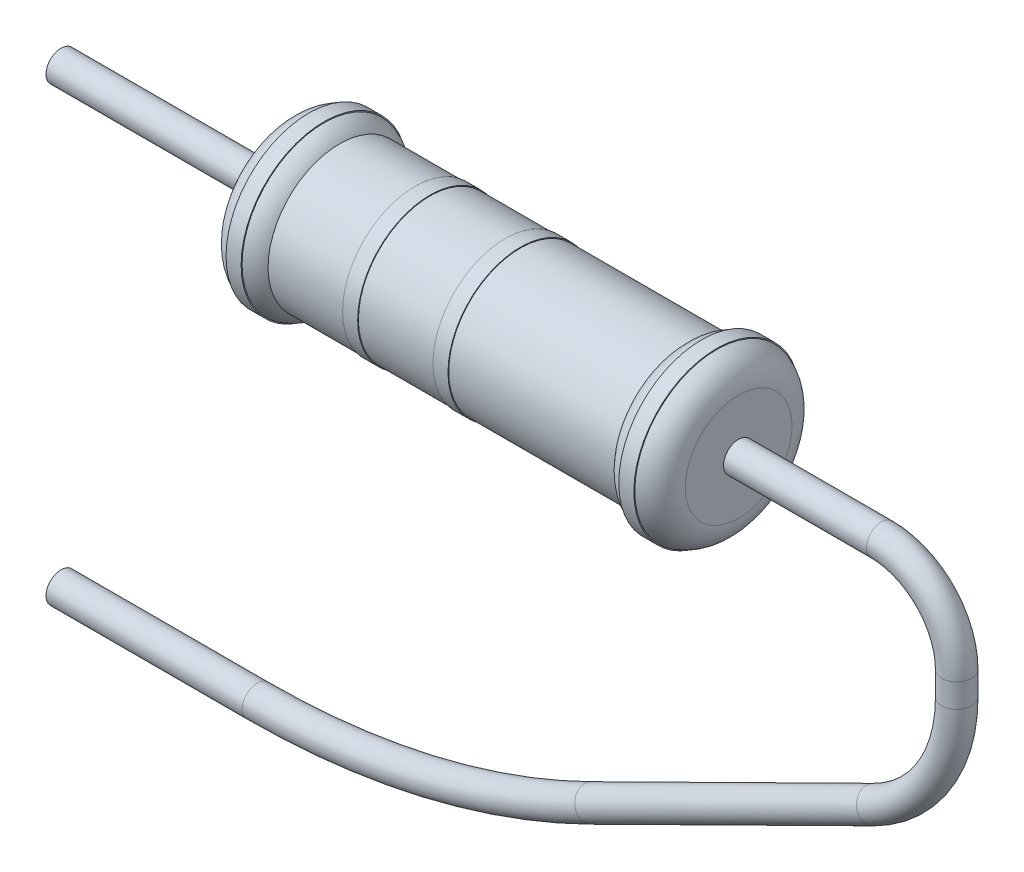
ISO-10303-21;
HEADER;
FILE_DESCRIPTION(('STEP AP214'),'2;1');
FILE_NAME('part.step','',(''),(''),'','','');
FILE_SCHEMA(('AUTOMOTIVE_DESIGN { 1 0 10303 214 1 1 1 1 }'));
ENDSEC;
DATA;
#1=APPLICATION_CONTEXT('core data for automotive mechanical design processes');
#2=APPLICATION_PROTOCOL_DEFINITION('international standard','automotive_design',2000,#1);
#3=PRODUCT_CONTEXT('',#1,'mechanical');
#4=PRODUCT('Part','Part','',(#3));
#5=PRODUCT_RELATED_PRODUCT_CATEGORY('part','',(#4));
#6=PRODUCT_DEFINITION_FORMATION('','',#4);
#7=PRODUCT_DEFINITION_CONTEXT('part definition',#1,'design');
#8=PRODUCT_DEFINITION('design','',#6,#7);
#9=PRODUCT_DEFINITION_SHAPE('','',#8);
#10=(LENGTH_UNIT() NAMED_UNIT(*) SI_UNIT(.MILLI.,.METRE.));
#11=(NAMED_UNIT(*) PLANE_ANGLE_UNIT() SI_UNIT($,.RADIAN.));
#12=(NAMED_UNIT(*) SI_UNIT($,.STERADIAN.) SOLID_ANGLE_UNIT());
#13=UNCERTAINTY_MEASURE_WITH_UNIT(LENGTH_MEASURE(1.E-05),#10,'distance_accuracy_value','');
#14=(GEOMETRIC_REPRESENTATION_CONTEXT(3) GLOBAL_UNCERTAINTY_ASSIGNED_CONTEXT((#13)) GLOBAL_UNIT_ASSIGNED_CONTEXT((#10,
#11,#12)) REPRESENTATION_CONTEXT('',''));
#15=CARTESIAN_POINT('',(0.,0.,0.));
#16=DIRECTION('',(0.,0.,1.));
#17=DIRECTION('',(1.,0.,0.));
#18=AXIS2_PLACEMENT_3D('',#15,#16,#17);
#19=CARTESIAN_POINT('',(3.,0.,0.));
#20=DIRECTION('',(-1.,0.,0.));
#21=DIRECTION('',(0.,0.,1.));
#22=AXIS2_PLACEMENT_3D('',#19,#20,#21);
#23=PLANE('',#22);
#24=CARTESIAN_POINT('',(3.,0.,0.));
#25=DIRECTION('',(-1.,0.,0.));
#26=DIRECTION('',(0.,0.,1.));
#27=AXIS2_PLACEMENT_3D('',#24,#25,#26);
#28=CIRCLE('',#27,0.708257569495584);
#29=CARTESIAN_POINT('',(3.,0.,0.708257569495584));
#30=VERTEX_POINT('',#29);
#31=EDGE_CURVE('E36',#30,#30,#28,.T.);
#32=ORIENTED_EDGE('',*,*,#31,.F.);
#33=EDGE_LOOP('',(#32));
#34=FACE_BOUND('',#33,.T.);
#35=CARTESIAN_POINT('',(3.,0.,0.));
#36=DIRECTION('',(1.,0.,0.));
#37=DIRECTION('',(0.,0.,-1.));
#38=AXIS2_PLACEMENT_3D('',#35,#36,#37);
#39=CIRCLE('',#38,0.2);
#40=CARTESIAN_POINT('',(3.,0.,-0.2));
#41=VERTEX_POINT('',#40);
#42=EDGE_CURVE('E10',#41,#41,#39,.T.);
#43=ORIENTED_EDGE('',*,*,#42,.F.);
#44=EDGE_LOOP('',(#43));
#45=FACE_BOUND('',#44,.T.);
#46=ADVANCED_FACE('F24',(#34,#45),#23,.F.);
#47=CARTESIAN_POINT('',(-3.,0.,0.));
#48=DIRECTION('',(1.,0.,0.));
#49=DIRECTION('',(0.,0.,-1.));
#50=AXIS2_PLACEMENT_3D('',#47,#48,#49);
#51=PLANE('',#50);
#52=CARTESIAN_POINT('',(-3.,0.,0.));
#53=DIRECTION('',(-1.,0.,0.));
#54=DIRECTION('',(0.,0.,1.));
#55=AXIS2_PLACEMENT_3D('',#52,#53,#54);
#56=CIRCLE('',#55,0.708257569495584);
#57=CARTESIAN_POINT('',(-3.,0.,0.708257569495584));
#58=VERTEX_POINT('',#57);
#59=EDGE_CURVE('E62',#58,#58,#56,.T.);
#60=ORIENTED_EDGE('',*,*,#59,.T.);
#61=EDGE_LOOP('',(#60));
#62=FACE_BOUND('',#61,.T.);
#63=CARTESIAN_POINT('',(-3.,0.,0.));
#64=DIRECTION('',(1.,0.,0.));
#65=DIRECTION('',(0.,0.,-1.));
#66=AXIS2_PLACEMENT_3D('',#63,#64,#65);
#67=CIRCLE('',#66,0.2);
#68=CARTESIAN_POINT('',(-3.,0.,-0.2));
#69=VERTEX_POINT('',#68);
#70=EDGE_CURVE('E28',#69,#69,#67,.F.);
#71=ORIENTED_EDGE('',*,*,#70,.F.);
#72=EDGE_LOOP('',(#71));
#73=FACE_BOUND('',#72,.T.);
#74=ADVANCED_FACE('F26',(#62,#73),#51,.F.);
#75=CARTESIAN_POINT('',(2.60825756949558,0.,0.));
#76=DIRECTION('',(-1.,0.,0.));
#77=DIRECTION('',(0.,0.,1.));
#78=AXIS2_PLACEMENT_3D('',#75,#76,#77);
#79=TOROIDAL_SURFACE('',#78,0.708257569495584,0.391742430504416);
#80=CARTESIAN_POINT('',(2.70825756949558,0.,0.));
#81=DIRECTION('',(-1.,0.,0.));
#82=DIRECTION('',(0.,0.,1.));
#83=AXIS2_PLACEMENT_3D('',#80,#81,#82);
#84=CIRCLE('',#83,1.08702152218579);
#85=CARTESIAN_POINT('',(2.70825756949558,0.,1.08702152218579));
#86=VERTEX_POINT('',#85);
#87=EDGE_CURVE('E116',#86,#86,#84,.T.);
#88=ORIENTED_EDGE('',*,*,#87,.F.);
#89=EDGE_LOOP('',(#88));
#90=FACE_BOUND('',#89,.T.);
#91=ORIENTED_EDGE('',*,*,#31,.T.);
#92=EDGE_LOOP('',(#91));
#93=FACE_BOUND('',#92,.T.);
#94=ADVANCED_FACE('F121',(#90,#93),#79,.T.);
#95=CARTESIAN_POINT('',(2.70825756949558,1.08702152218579,0.));
#96=DIRECTION('',(-1.,0.,0.));
#97=DIRECTION('',(0.,0.,1.));
#98=AXIS2_PLACEMENT_3D('',#95,#96,#97);
#99=PLANE('',#98);
#100=CARTESIAN_POINT('',(2.70825756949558,0.,0.));
#101=DIRECTION('',(-1.,0.,0.));
#102=DIRECTION('',(0.,0.,1.));
#103=AXIS2_PLACEMENT_3D('',#100,#101,#102);
#104=CIRCLE('',#103,1.1);
#105=CARTESIAN_POINT('',(2.70825756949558,0.,1.1));
#106=VERTEX_POINT('',#105);
#107=EDGE_CURVE('E113',#106,#106,#104,.T.);
#108=ORIENTED_EDGE('',*,*,#107,.F.);
#109=EDGE_LOOP('',(#108));
#110=FACE_BOUND('',#109,.T.);
#111=ORIENTED_EDGE('',*,*,#87,.T.);
#112=EDGE_LOOP('',(#111));
#113=FACE_BOUND('',#112,.T.);
#114=ADVANCED_FACE('F134',(#110,#113),#99,.F.);
#115=CARTESIAN_POINT('',(-9.42004899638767,0.,0.));
#116=DIRECTION('',(-1.,0.,0.));
#117=DIRECTION('',(0.,0.,1.));
#118=AXIS2_PLACEMENT_3D('',#115,#116,#117);
#119=CYLINDRICAL_SURFACE('',#118,1.1);
#120=CARTESIAN_POINT('',(2.50825756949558,0.,0.));
#121=DIRECTION('',(-1.,0.,0.));
#122=DIRECTION('',(0.,0.,1.));
#123=AXIS2_PLACEMENT_3D('',#120,#121,#122);
#124=CIRCLE('',#123,1.1);
#125=CARTESIAN_POINT('',(2.50825756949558,0.,1.1));
#126=VERTEX_POINT('',#125);
#127=EDGE_CURVE('E110',#126,#126,#124,.T.);
#128=ORIENTED_EDGE('',*,*,#127,.F.);
#129=EDGE_LOOP('',(#128));
#130=FACE_BOUND('',#129,.T.);
#131=ORIENTED_EDGE('',*,*,#107,.T.);
#132=EDGE_LOOP('',(#131));
#133=FACE_BOUND('',#132,.T.);
#134=ADVANCED_FACE('F138',(#130,#133),#119,.T.);
#135=CARTESIAN_POINT('',(2.50825756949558,1.08702152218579,0.));
#136=DIRECTION('',(1.,0.,0.));
#137=DIRECTION('',(0.,0.,-1.));
#138=AXIS2_PLACEMENT_3D('',#135,#136,#137);
#139=PLANE('',#138);
#140=CARTESIAN_POINT('',(2.50825756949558,0.,0.));
#141=DIRECTION('',(-1.,0.,0.));
#142=DIRECTION('',(0.,0.,1.));
#143=AXIS2_PLACEMENT_3D('',#140,#141,#142);
#144=CIRCLE('',#143,1.08702152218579);
#145=CARTESIAN_POINT('',(2.50825756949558,0.,1.08702152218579));
#146=VERTEX_POINT('',#145);
#147=EDGE_CURVE('E107',#146,#146,#144,.T.);
#148=ORIENTED_EDGE('',*,*,#147,.F.);
#149=EDGE_LOOP('',(#148));
#150=FACE_BOUND('',#149,.T.);
#151=ORIENTED_EDGE('',*,*,#127,.T.);
#152=EDGE_LOOP('',(#151));
#153=FACE_BOUND('',#152,.T.);
#154=ADVANCED_FACE('F142',(#150,#153),#139,.F.);
#155=CARTESIAN_POINT('',(2.60825756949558,0.,0.));
#156=DIRECTION('',(-1.,0.,0.));
#157=DIRECTION('',(0.,0.,1.));
#158=AXIS2_PLACEMENT_3D('',#155,#156,#157);
#159=TOROIDAL_SURFACE('',#158,0.708257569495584,0.391742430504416);
#160=CARTESIAN_POINT('',(2.3,0.,0.));
#161=DIRECTION('',(-1.,0.,0.));
#162=DIRECTION('',(0.,0.,1.));
#163=AXIS2_PLACEMENT_3D('',#160,#161,#162);
#164=CIRCLE('',#163,0.95);
#165=CARTESIAN_POINT('',(2.3,0.,0.95));
#166=VERTEX_POINT('',#165);
#167=EDGE_CURVE('E104',#166,#166,#164,.T.);
#168=ORIENTED_EDGE('',*,*,#167,.F.);
#169=EDGE_LOOP('',(#168));
#170=FACE_BOUND('',#169,.T.);
#171=ORIENTED_EDGE('',*,*,#147,.T.);
#172=EDGE_LOOP('',(#171));
#173=FACE_BOUND('',#172,.T.);
#174=ADVANCED_FACE('F146',(#170,#173),#159,.T.);
#175=CARTESIAN_POINT('',(-9.42004899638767,0.,0.));
#176=DIRECTION('',(-1.,0.,0.));
#177=DIRECTION('',(0.,0.,1.));
#178=AXIS2_PLACEMENT_3D('',#175,#176,#177);
#179=CYLINDRICAL_SURFACE('',#178,0.95);
#180=CARTESIAN_POINT('',(0.0999999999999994,0.,0.));
#181=DIRECTION('',(-1.,0.,0.));
#182=DIRECTION('',(0.,0.,1.));
#183=AXIS2_PLACEMENT_3D('',#180,#181,#182);
#184=CIRCLE('',#183,0.95);
#185=CARTESIAN_POINT('',(0.0999999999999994,0.,0.95));
#186=VERTEX_POINT('',#185);
#187=EDGE_CURVE('E101',#186,#186,#184,.T.);
#188=ORIENTED_EDGE('',*,*,#187,.F.);
#189=EDGE_LOOP('',(#188));
#190=FACE_BOUND('',#189,.T.);
#191=ORIENTED_EDGE('',*,*,#167,.T.);
#192=EDGE_LOOP('',(#191));
#193=FACE_BOUND('',#192,.T.);
#194=ADVANCED_FACE('F150',(#190,#193),#179,.T.);
#195=CARTESIAN_POINT('',(0.1,0.95,0.));
#196=DIRECTION('',(-1.,0.,0.));
#197=DIRECTION('',(0.,0.,1.));
#198=AXIS2_PLACEMENT_3D('',#195,#196,#197);
#199=PLANE('',#198);
#200=CARTESIAN_POINT('',(0.0999999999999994,0.,0.));
#201=DIRECTION('',(-1.,0.,0.));
#202=DIRECTION('',(0.,0.,1.));
#203=AXIS2_PLACEMENT_3D('',#200,#201,#202);
#204=CIRCLE('',#203,0.96);
#205=CARTESIAN_POINT('',(0.0999999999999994,0.,0.96));
#206=VERTEX_POINT('',#205);
#207=EDGE_CURVE('E98',#206,#206,#204,.T.);
#208=ORIENTED_EDGE('',*,*,#207,.F.);
#209=EDGE_LOOP('',(#208));
#210=FACE_BOUND('',#209,.T.);
#211=ORIENTED_EDGE('',*,*,#187,.T.);
#212=EDGE_LOOP('',(#211));
#213=FACE_BOUND('',#212,.T.);
#214=ADVANCED_FACE('F154',(#210,#213),#199,.F.);
#215=CARTESIAN_POINT('',(-9.42004899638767,0.,0.));
#216=DIRECTION('',(-1.,0.,0.));
#217=DIRECTION('',(0.,0.,1.));
#218=AXIS2_PLACEMENT_3D('',#215,#216,#217);
#219=CYLINDRICAL_SURFACE('',#218,0.96);
#220=CARTESIAN_POINT('',(-0.0999999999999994,0.,0.));
#221=DIRECTION('',(-1.,0.,0.));
#222=DIRECTION('',(0.,0.,1.));
#223=AXIS2_PLACEMENT_3D('',#220,#221,#222);
#224=CIRCLE('',#223,0.96);
#225=CARTESIAN_POINT('',(-0.0999999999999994,0.,0.96));
#226=VERTEX_POINT('',#225);
#227=EDGE_CURVE('E95',#226,#226,#224,.T.);
#228=ORIENTED_EDGE('',*,*,#227,.F.);
#229=EDGE_LOOP('',(#228));
#230=FACE_BOUND('',#229,.T.);
#231=ORIENTED_EDGE('',*,*,#207,.T.);
#232=EDGE_LOOP('',(#231));
#233=FACE_BOUND('',#232,.T.);
#234=ADVANCED_FACE('F158',(#230,#233),#219,.T.);
#235=CARTESIAN_POINT('',(-0.1,0.95,0.));
#236=DIRECTION('',(1.,0.,0.));
#237=DIRECTION('',(0.,0.,-1.));
#238=AXIS2_PLACEMENT_3D('',#235,#236,#237);
#239=PLANE('',#238);
#240=CARTESIAN_POINT('',(-0.0999999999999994,0.,0.));
#241=DIRECTION('',(-1.,0.,0.));
#242=DIRECTION('',(0.,0.,1.));
#243=AXIS2_PLACEMENT_3D('',#240,#241,#242);
#244=CIRCLE('',#243,0.95);
#245=CARTESIAN_POINT('',(-0.0999999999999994,0.,0.95));
#246=VERTEX_POINT('',#245);
#247=EDGE_CURVE('E92',#246,#246,#244,.T.);
#248=ORIENTED_EDGE('',*,*,#247,.F.);
#249=EDGE_LOOP('',(#248));
#250=FACE_BOUND('',#249,.T.);
#251=ORIENTED_EDGE('',*,*,#227,.T.);
#252=EDGE_LOOP('',(#251));
#253=FACE_BOUND('',#252,.T.);
#254=ADVANCED_FACE('F162',(#250,#253),#239,.F.);
#255=CARTESIAN_POINT('',(-9.42004899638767,0.,0.));
#256=DIRECTION('',(-1.,0.,0.));
#257=DIRECTION('',(0.,0.,1.));
#258=AXIS2_PLACEMENT_3D('',#255,#256,#257);
#259=CYLINDRICAL_SURFACE('',#258,0.95);
#260=CARTESIAN_POINT('',(-1.1,0.,0.));
#261=DIRECTION('',(-1.,0.,0.));
#262=DIRECTION('',(0.,0.,1.));
#263=AXIS2_PLACEMENT_3D('',#260,#261,#262);
#264=CIRCLE('',#263,0.95);
#265=CARTESIAN_POINT('',(-1.1,0.,0.95));
#266=VERTEX_POINT('',#265);
#267=EDGE_CURVE('E89',#266,#266,#264,.T.);
#268=ORIENTED_EDGE('',*,*,#267,.F.);
#269=EDGE_LOOP('',(#268));
#270=FACE_BOUND('',#269,.T.);
#271=ORIENTED_EDGE('',*,*,#247,.T.);
#272=EDGE_LOOP('',(#271));
#273=FACE_BOUND('',#272,.T.);
#274=ADVANCED_FACE('F166',(#270,#273),#259,.T.);
#275=CARTESIAN_POINT('',(-1.1,0.95,0.));
#276=DIRECTION('',(-1.,0.,0.));
#277=DIRECTION('',(0.,0.,1.));
#278=AXIS2_PLACEMENT_3D('',#275,#276,#277);
#279=PLANE('',#278);
#280=CARTESIAN_POINT('',(-1.1,0.,0.));
#281=DIRECTION('',(-1.,0.,0.));
#282=DIRECTION('',(0.,0.,1.));
#283=AXIS2_PLACEMENT_3D('',#280,#281,#282);
#284=CIRCLE('',#283,0.96);
#285=CARTESIAN_POINT('',(-1.1,0.,0.96));
#286=VERTEX_POINT('',#285);
#287=EDGE_CURVE('E86',#286,#286,#284,.T.);
#288=ORIENTED_EDGE('',*,*,#287,.F.);
#289=EDGE_LOOP('',(#288));
#290=FACE_BOUND('',#289,.T.);
#291=ORIENTED_EDGE('',*,*,#267,.T.);
#292=EDGE_LOOP('',(#291));
#293=FACE_BOUND('',#292,.T.);
#294=ADVANCED_FACE('F170',(#290,#293),#279,.F.);
#295=CARTESIAN_POINT('',(-9.42004899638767,0.,0.));
#296=DIRECTION('',(-1.,0.,0.));
#297=DIRECTION('',(0.,0.,1.));
#298=AXIS2_PLACEMENT_3D('',#295,#296,#297);
#299=CYLINDRICAL_SURFACE('',#298,0.96);
#300=CARTESIAN_POINT('',(-1.3,0.,0.));
#301=DIRECTION('',(-1.,0.,0.));
#302=DIRECTION('',(0.,0.,1.));
#303=AXIS2_PLACEMENT_3D('',#300,#301,#302);
#304=CIRCLE('',#303,0.96);
#305=CARTESIAN_POINT('',(-1.3,0.,0.96));
#306=VERTEX_POINT('',#305);
#307=EDGE_CURVE('E83',#306,#306,#304,.T.);
#308=ORIENTED_EDGE('',*,*,#307,.F.);
#309=EDGE_LOOP('',(#308));
#310=FACE_BOUND('',#309,.T.);
#311=ORIENTED_EDGE('',*,*,#287,.T.);
#312=EDGE_LOOP('',(#311));
#313=FACE_BOUND('',#312,.T.);
#314=ADVANCED_FACE('F174',(#310,#313),#299,.T.);
#315=CARTESIAN_POINT('',(-1.3,0.95,0.));
#316=DIRECTION('',(1.,0.,0.));
#317=DIRECTION('',(0.,0.,-1.));
#318=AXIS2_PLACEMENT_3D('',#315,#316,#317);
#319=PLANE('',#318);
#320=CARTESIAN_POINT('',(-1.3,0.,0.));
#321=DIRECTION('',(-1.,0.,0.));
#322=DIRECTION('',(0.,0.,1.));
#323=AXIS2_PLACEMENT_3D('',#320,#321,#322);
#324=CIRCLE('',#323,0.95);
#325=CARTESIAN_POINT('',(-1.3,0.,0.95));
#326=VERTEX_POINT('',#325);
#327=EDGE_CURVE('E80',#326,#326,#324,.T.);
#328=ORIENTED_EDGE('',*,*,#327,.F.);
#329=EDGE_LOOP('',(#328));
#330=FACE_BOUND('',#329,.T.);
#331=ORIENTED_EDGE('',*,*,#307,.T.);
#332=EDGE_LOOP('',(#331));
#333=FACE_BOUND('',#332,.T.);
#334=ADVANCED_FACE('F178',(#330,#333),#319,.F.);
#335=CARTESIAN_POINT('',(-9.42004899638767,0.,0.));
#336=DIRECTION('',(-1.,0.,0.));
#337=DIRECTION('',(0.,0.,1.));
#338=AXIS2_PLACEMENT_3D('',#335,#336,#337);
#339=CYLINDRICAL_SURFACE('',#338,0.95);
#340=CARTESIAN_POINT('',(-2.3,0.,0.));
#341=DIRECTION('',(-1.,0.,0.));
#342=DIRECTION('',(0.,0.,1.));
#343=AXIS2_PLACEMENT_3D('',#340,#341,#342);
#344=CIRCLE('',#343,0.95);
#345=CARTESIAN_POINT('',(-2.3,0.,0.95));
#346=VERTEX_POINT('',#345);
#347=EDGE_CURVE('E77',#346,#346,#344,.T.);
#348=ORIENTED_EDGE('',*,*,#347,.F.);
#349=EDGE_LOOP('',(#348));
#350=FACE_BOUND('',#349,.T.);
#351=ORIENTED_EDGE('',*,*,#327,.T.);
#352=EDGE_LOOP('',(#351));
#353=FACE_BOUND('',#352,.T.);
#354=ADVANCED_FACE('F182',(#350,#353),#339,.T.);
#355=CARTESIAN_POINT('',(-2.60825756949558,0.,0.));
#356=DIRECTION('',(-1.,0.,0.));
#357=DIRECTION('',(0.,0.,1.));
#358=AXIS2_PLACEMENT_3D('',#355,#356,#357);
#359=TOROIDAL_SURFACE('',#358,0.708257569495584,0.391742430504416);
#360=CARTESIAN_POINT('',(-2.50825756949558,0.,0.));
#361=DIRECTION('',(-1.,0.,0.));
#362=DIRECTION('',(0.,0.,1.));
#363=AXIS2_PLACEMENT_3D('',#360,#361,#362);
#364=CIRCLE('',#363,1.08702152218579);
#365=CARTESIAN_POINT('',(-2.50825756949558,0.,1.08702152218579));
#366=VERTEX_POINT('',#365);
#367=EDGE_CURVE('E74',#366,#366,#364,.T.);
#368=ORIENTED_EDGE('',*,*,#367,.F.);
#369=EDGE_LOOP('',(#368));
#370=FACE_BOUND('',#369,.T.);
#371=ORIENTED_EDGE('',*,*,#347,.T.);
#372=EDGE_LOOP('',(#371));
#373=FACE_BOUND('',#372,.T.);
#374=ADVANCED_FACE('F186',(#370,#373),#359,.T.);
#375=CARTESIAN_POINT('',(-2.50825756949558,1.08702152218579,0.));
#376=DIRECTION('',(-1.,0.,0.));
#377=DIRECTION('',(0.,0.,1.));
#378=AXIS2_PLACEMENT_3D('',#375,#376,#377);
#379=PLANE('',#378);
#380=CARTESIAN_POINT('',(-2.50825756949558,0.,0.));
#381=DIRECTION('',(-1.,0.,0.));
#382=DIRECTION('',(0.,0.,1.));
#383=AXIS2_PLACEMENT_3D('',#380,#381,#382);
#384=CIRCLE('',#383,1.1);
#385=CARTESIAN_POINT('',(-2.50825756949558,0.,1.1));
#386=VERTEX_POINT('',#385);
#387=EDGE_CURVE('E71',#386,#386,#384,.T.);
#388=ORIENTED_EDGE('',*,*,#387,.F.);
#389=EDGE_LOOP('',(#388));
#390=FACE_BOUND('',#389,.T.);
#391=ORIENTED_EDGE('',*,*,#367,.T.);
#392=EDGE_LOOP('',(#391));
#393=FACE_BOUND('',#392,.T.);
#394=ADVANCED_FACE('F190',(#390,#393),#379,.F.);
#395=CARTESIAN_POINT('',(-9.42004899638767,0.,0.));
#396=DIRECTION('',(-1.,0.,0.));
#397=DIRECTION('',(0.,0.,1.));
#398=AXIS2_PLACEMENT_3D('',#395,#396,#397);
#399=CYLINDRICAL_SURFACE('',#398,1.1);
#400=CARTESIAN_POINT('',(-2.70825756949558,0.,0.));
#401=DIRECTION('',(-1.,0.,0.));
#402=DIRECTION('',(0.,0.,1.));
#403=AXIS2_PLACEMENT_3D('',#400,#401,#402);
#404=CIRCLE('',#403,1.1);
#405=CARTESIAN_POINT('',(-2.70825756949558,0.,1.1));
#406=VERTEX_POINT('',#405);
#407=EDGE_CURVE('E68',#406,#406,#404,.T.);
#408=ORIENTED_EDGE('',*,*,#407,.F.);
#409=EDGE_LOOP('',(#408));
#410=FACE_BOUND('',#409,.T.);
#411=ORIENTED_EDGE('',*,*,#387,.T.);
#412=EDGE_LOOP('',(#411));
#413=FACE_BOUND('',#412,.T.);
#414=ADVANCED_FACE('F194',(#410,#413),#399,.T.);
#415=CARTESIAN_POINT('',(-2.70825756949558,1.08702152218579,0.));
#416=DIRECTION('',(1.,0.,0.));
#417=DIRECTION('',(0.,0.,-1.));
#418=AXIS2_PLACEMENT_3D('',#415,#416,#417);
#419=PLANE('',#418);
#420=CARTESIAN_POINT('',(-2.70825756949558,0.,0.));
#421=DIRECTION('',(-1.,0.,0.));
#422=DIRECTION('',(0.,0.,1.));
#423=AXIS2_PLACEMENT_3D('',#420,#421,#422);
#424=CIRCLE('',#423,1.08702152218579);
#425=CARTESIAN_POINT('',(-2.70825756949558,0.,1.08702152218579));
#426=VERTEX_POINT('',#425);
#427=EDGE_CURVE('E65',#426,#426,#424,.T.);
#428=ORIENTED_EDGE('',*,*,#427,.F.);
#429=EDGE_LOOP('',(#428));
#430=FACE_BOUND('',#429,.T.);
#431=ORIENTED_EDGE('',*,*,#407,.T.);
#432=EDGE_LOOP('',(#431));
#433=FACE_BOUND('',#432,.T.);
#434=ADVANCED_FACE('F198',(#430,#433),#419,.F.);
#435=CARTESIAN_POINT('',(-2.60825756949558,0.,0.));
#436=DIRECTION('',(-1.,0.,0.));
#437=DIRECTION('',(0.,0.,1.));
#438=AXIS2_PLACEMENT_3D('',#435,#436,#437);
#439=TOROIDAL_SURFACE('',#438,0.708257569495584,0.391742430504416);
#440=ORIENTED_EDGE('',*,*,#59,.F.);
#441=EDGE_LOOP('',(#440));
#442=FACE_BOUND('',#441,.T.);
#443=ORIENTED_EDGE('',*,*,#427,.T.);
#444=EDGE_LOOP('',(#443));
#445=FACE_BOUND('',#444,.T.);
#446=ADVANCED_FACE('F202',(#442,#445),#439,.T.);
#447=CARTESIAN_POINT('',(-6.,0.,0.));
#448=DIRECTION('',(1.,0.,0.));
#449=DIRECTION('',(0.,0.,-1.));
#450=AXIS2_PLACEMENT_3D('',#447,#448,#449);
#451=CYLINDRICAL_SURFACE('',#450,0.2);
#452=CARTESIAN_POINT('',(-6.,0.,0.));
#453=DIRECTION('',(-1.,0.,0.));
#454=DIRECTION('',(0.,0.,1.));
#455=AXIS2_PLACEMENT_3D('',#452,#453,#454);
#456=CIRCLE('',#455,0.2);
#457=CARTESIAN_POINT('',(-6.,0.,0.2));
#458=VERTEX_POINT('',#457);
#459=EDGE_CURVE('E59',#458,#458,#456,.T.);
#460=ORIENTED_EDGE('',*,*,#459,.F.);
#461=EDGE_LOOP('',(#460));
#462=FACE_BOUND('',#461,.T.);
#463=ORIENTED_EDGE('',*,*,#70,.T.);
#464=EDGE_LOOP('',(#463));
#465=FACE_BOUND('',#464,.T.);
#466=ADVANCED_FACE('F206',(#462,#465),#451,.T.);
#467=CARTESIAN_POINT('',(-6.,0.,0.));
#468=DIRECTION('',(-1.,0.,0.));
#469=DIRECTION('',(0.,0.,1.));
#470=AXIS2_PLACEMENT_3D('',#467,#468,#469);
#471=PLANE('',#470);
#472=ORIENTED_EDGE('',*,*,#459,.T.);
#473=EDGE_LOOP('',(#472));
#474=FACE_BOUND('',#473,.T.);
#475=ADVANCED_FACE('F210',(#474),#471,.T.);
#476=CARTESIAN_POINT('',(-3.39435098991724,-6.,0.));
#477=DIRECTION('',(-1.,0.,0.));
#478=DIRECTION('',(0.,0.,1.));
#479=AXIS2_PLACEMENT_3D('',#476,#477,#478);
#480=CYLINDRICAL_SURFACE('',#479,0.2);
#481=CARTESIAN_POINT('',(-3.39435098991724,-6.,0.));
#482=DIRECTION('',(-1.,0.,0.));
#483=DIRECTION('',(0.,0.,-1.));
#484=AXIS2_PLACEMENT_3D('',#481,#482,#483);
#485=CIRCLE('',#484,0.2);
#486=CARTESIAN_POINT('',(-3.39435098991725,-6.2,0.));
#487=VERTEX_POINT('',#486);
#488=EDGE_CURVE('E53',#487,#487,#485,.T.);
#489=ORIENTED_EDGE('',*,*,#488,.T.);
#490=EDGE_LOOP('',(#489));
#491=FACE_BOUND('',#490,.T.);
#492=CARTESIAN_POINT('',(-6.,-6.,0.));
#493=DIRECTION('',(-1.,0.,0.));
#494=DIRECTION('',(0.,0.,-1.));
#495=AXIS2_PLACEMENT_3D('',#492,#493,#494);
#496=CIRCLE('',#495,0.2);
#497=CARTESIAN_POINT('',(-6.,-6.,-0.2));
#498=VERTEX_POINT('',#497);
#499=EDGE_CURVE('E56',#498,#498,#496,.T.);
#500=ORIENTED_EDGE('',*,*,#499,.F.);
#501=EDGE_LOOP('',(#500));
#502=FACE_BOUND('',#501,.T.);
#503=ADVANCED_FACE('F213',(#491,#502),#480,.T.);
#504=CARTESIAN_POINT('',(-3.39435098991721,4.,0.));
#505=DIRECTION('',(0.,0.,-1.));
#506=DIRECTION('',(-1.,0.,0.));
#507=AXIS2_PLACEMENT_3D('',#504,#505,#506);
#508=TOROIDAL_SURFACE('',#507,10.,0.2);
#509=CARTESIAN_POINT('',(1.04182039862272,-4.96216399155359,0.));
#510=DIRECTION('',(-0.896216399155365,-0.44361713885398,0.));
#511=DIRECTION('',(0.,0.,-1.));
#512=AXIS2_PLACEMENT_3D('',#509,#510,#511);
#513=CIRCLE('',#512,0.2);
#514=CARTESIAN_POINT('',(1.13054382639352,-5.14140727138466,0.));
#515=VERTEX_POINT('',#514);
#516=EDGE_CURVE('E50',#515,#515,#513,.T.);
#517=CARTESIAN_POINT('',(-3.39435098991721,4.,0.));
#518=DIRECTION('',(0.,0.,-1.));
#519=DIRECTION('',(-1.,0.,0.));
#520=AXIS2_PLACEMENT_3D('',#517,#518,#519);
#521=CIRCLE('',#520,10.2);
#522=EDGE_CURVE('',#515,#487,#521,.T.);
#523=ORIENTED_EDGE('',*,*,#516,.T.);
#524=ORIENTED_EDGE('',*,*,#488,.F.);
#525=ORIENTED_EDGE('',*,*,#522,.T.);
#526=ORIENTED_EDGE('',*,*,#522,.F.);
#527=EDGE_LOOP('',(#523,#525,#524,#526));
#528=FACE_BOUND('',#527,.T.);
#529=ADVANCED_FACE('F216',(#528),#508,.T.);
#530=CARTESIAN_POINT('',(4.78493773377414,-3.1093625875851,0.));
#531=DIRECTION('',(-0.896216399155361,-0.443617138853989,0.));
#532=DIRECTION('',(0.443617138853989,-0.896216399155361,0.));
#533=AXIS2_PLACEMENT_3D('',#530,#531,#532);
#534=CYLINDRICAL_SURFACE('',#533,0.2);
#535=CARTESIAN_POINT('',(4.78493773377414,-3.1093625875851,0.));
#536=DIRECTION('',(-0.896216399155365,-0.44361713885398,0.));
#537=DIRECTION('',(0.,0.,-1.));
#538=AXIS2_PLACEMENT_3D('',#535,#536,#537);
#539=CIRCLE('',#538,0.2);
#540=CARTESIAN_POINT('',(4.87366116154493,-3.28860586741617,0.));
#541=VERTEX_POINT('',#540);
#542=EDGE_CURVE('E47',#541,#541,#539,.T.);
#543=ORIENTED_EDGE('',*,*,#542,.T.);
#544=EDGE_LOOP('',(#543));
#545=FACE_BOUND('',#544,.T.);
#546=ORIENTED_EDGE('',*,*,#516,.F.);
#547=EDGE_LOOP('',(#546));
#548=FACE_BOUND('',#547,.T.);
#549=ADVANCED_FACE('F220',(#545,#548),#534,.T.);
#550=CARTESIAN_POINT('',(3.89770345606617,-1.31692978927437,0.));
#551=DIRECTION('',(0.,0.,-1.));
#552=DIRECTION('',(-1.,0.,0.));
#553=AXIS2_PLACEMENT_3D('',#550,#551,#552);
#554=TOROIDAL_SURFACE('',#553,2.,0.2);
#555=CARTESIAN_POINT('',(5.89770345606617,-1.31692978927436,0.));
#556=DIRECTION('',(0.,-1.,0.));
#557=DIRECTION('',(0.,0.,-1.));
#558=AXIS2_PLACEMENT_3D('',#555,#556,#557);
#559=CIRCLE('',#558,0.2);
#560=CARTESIAN_POINT('',(6.09770345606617,-1.31692978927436,0.));
#561=VERTEX_POINT('',#560);
#562=EDGE_CURVE('E44',#561,#561,#559,.T.);
#563=CARTESIAN_POINT('',(3.89770345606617,-1.31692978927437,0.));
#564=DIRECTION('',(0.,0.,-1.));
#565=DIRECTION('',(-1.,0.,0.));
#566=AXIS2_PLACEMENT_3D('',#563,#564,#565);
#567=CIRCLE('',#566,2.2);
#568=EDGE_CURVE('',#561,#541,#567,.T.);
#569=ORIENTED_EDGE('',*,*,#562,.T.);
#570=ORIENTED_EDGE('',*,*,#542,.F.);
#571=ORIENTED_EDGE('',*,*,#568,.T.);
#572=ORIENTED_EDGE('',*,*,#568,.F.);
#573=EDGE_LOOP('',(#569,#571,#570,#572));
#574=FACE_BOUND('',#573,.T.);
#575=ADVANCED_FACE('F224',(#574),#554,.T.);
#576=CARTESIAN_POINT('',(5.89770345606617,-1.,0.));
#577=DIRECTION('',(0.,-1.,0.));
#578=DIRECTION('',(0.,0.,-1.));
#579=AXIS2_PLACEMENT_3D('',#576,#577,#578);
#580=CYLINDRICAL_SURFACE('',#579,0.2);
#581=CARTESIAN_POINT('',(5.89770345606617,-1.,0.));
#582=DIRECTION('',(0.,-1.,0.));
#583=DIRECTION('',(0.,0.,-1.));
#584=AXIS2_PLACEMENT_3D('',#581,#582,#583);
#585=CIRCLE('',#584,0.2);
#586=CARTESIAN_POINT('',(6.09770345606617,-1.,0.));
#587=VERTEX_POINT('',#586);
#588=EDGE_CURVE('E41',#587,#587,#585,.T.);
#589=ORIENTED_EDGE('',*,*,#588,.T.);
#590=EDGE_LOOP('',(#589));
#591=FACE_BOUND('',#590,.T.);
#592=ORIENTED_EDGE('',*,*,#562,.F.);
#593=EDGE_LOOP('',(#592));
#594=FACE_BOUND('',#593,.T.);
#595=ADVANCED_FACE('F228',(#591,#594),#580,.T.);
#596=CARTESIAN_POINT('',(4.89770345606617,-1.,0.));
#597=DIRECTION('',(0.,0.,-1.));
#598=DIRECTION('',(-1.,0.,0.));
#599=AXIS2_PLACEMENT_3D('',#596,#597,#598);
#600=TOROIDAL_SURFACE('',#599,1.,0.2);
#601=CARTESIAN_POINT('',(4.89770345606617,0.,0.));
#602=DIRECTION('',(1.,0.,0.));
#603=DIRECTION('',(0.,0.,-1.));
#604=AXIS2_PLACEMENT_3D('',#601,#602,#603);
#605=CIRCLE('',#604,0.2);
#606=CARTESIAN_POINT('',(4.89770345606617,0.2,0.));
#607=VERTEX_POINT('',#606);
#608=EDGE_CURVE('E38',#607,#607,#605,.T.);
#609=CARTESIAN_POINT('',(4.89770345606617,-1.,0.));
#610=DIRECTION('',(0.,0.,-1.));
#611=DIRECTION('',(-1.,0.,0.));
#612=AXIS2_PLACEMENT_3D('',#609,#610,#611);
#613=CIRCLE('',#612,1.2);
#614=EDGE_CURVE('',#607,#587,#613,.T.);
#615=ORIENTED_EDGE('',*,*,#608,.T.);
#616=ORIENTED_EDGE('',*,*,#588,.F.);
#617=ORIENTED_EDGE('',*,*,#614,.T.);
#618=ORIENTED_EDGE('',*,*,#614,.F.);
#619=EDGE_LOOP('',(#615,#617,#616,#618));
#620=FACE_BOUND('',#619,.T.);
#621=ADVANCED_FACE('F232',(#620),#600,.T.);
#622=CARTESIAN_POINT('',(4.89770345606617,0.,0.));
#623=DIRECTION('',(-1.,0.,0.));
#624=DIRECTION('',(0.,-1.,0.));
#625=AXIS2_PLACEMENT_3D('',#622,#623,#624);
#626=CYLINDRICAL_SURFACE('',#625,0.2);
#627=ORIENTED_EDGE('',*,*,#608,.F.);
#628=EDGE_LOOP('',(#627));
#629=FACE_BOUND('',#628,.T.);
#630=ORIENTED_EDGE('',*,*,#42,.T.);
#631=EDGE_LOOP('',(#630));
#632=FACE_BOUND('',#631,.T.);
#633=ADVANCED_FACE('F236',(#629,#632),#626,.T.);
#634=CARTESIAN_POINT('',(-6.,-6.,0.));
#635=DIRECTION('',(-1.,0.,0.));
#636=DIRECTION('',(0.,0.,-1.));
#637=AXIS2_PLACEMENT_3D('',#634,#635,#636);
#638=PLANE('',#637);
#639=ORIENTED_EDGE('',*,*,#499,.T.);
#640=EDGE_LOOP('',(#639));
#641=FACE_BOUND('',#640,.T.);
#642=ADVANCED_FACE('F240',(#641),#638,.T.);
#643=CLOSED_SHELL('',(#46,#74,#94,#114,#134,#154,#174,#194,#214,#234,#254,#274,#294,#314,#334,
#354,#374,#394,#414,#434,#446,#466,#475,#503,#529,#549,#575,#595,#621,#633,#642));
#644=MANIFOLD_SOLID_BREP('B2',#643);
#645=ADVANCED_BREP_SHAPE_REPRESENTATION('',(#18,#644),#14);
#646=SHAPE_DEFINITION_REPRESENTATION(#9,#645);
ENDSEC;
END-ISO-10303-21;
